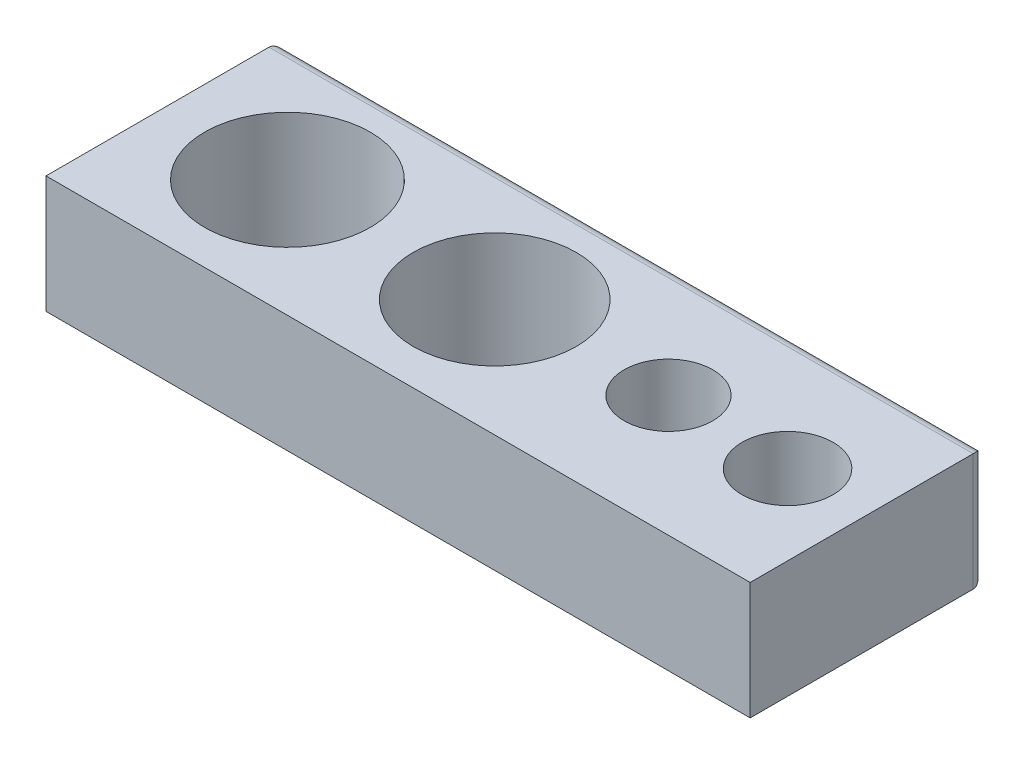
ISO-10303-21;
HEADER;
FILE_DESCRIPTION(('STEP AP214'),'2;1');
FILE_NAME('part.step','',(''),(''),'','','');
FILE_SCHEMA(('AUTOMOTIVE_DESIGN { 1 0 10303 214 1 1 1 1 }'));
ENDSEC;
DATA;
#1=APPLICATION_CONTEXT('core data for automotive mechanical design processes');
#2=APPLICATION_PROTOCOL_DEFINITION('international standard','automotive_design',2000,#1);
#3=PRODUCT_CONTEXT('',#1,'mechanical');
#4=PRODUCT('Part','Part','',(#3));
#5=PRODUCT_RELATED_PRODUCT_CATEGORY('part','',(#4));
#6=PRODUCT_DEFINITION_FORMATION('','',#4);
#7=PRODUCT_DEFINITION_CONTEXT('part definition',#1,'design');
#8=PRODUCT_DEFINITION('design','',#6,#7);
#9=PRODUCT_DEFINITION_SHAPE('','',#8);
#10=(LENGTH_UNIT() NAMED_UNIT(*) SI_UNIT(.MILLI.,.METRE.));
#11=(NAMED_UNIT(*) PLANE_ANGLE_UNIT() SI_UNIT($,.RADIAN.));
#12=(NAMED_UNIT(*) SI_UNIT($,.STERADIAN.) SOLID_ANGLE_UNIT());
#13=UNCERTAINTY_MEASURE_WITH_UNIT(LENGTH_MEASURE(1.E-05),#10,'distance_accuracy_value','');
#14=(GEOMETRIC_REPRESENTATION_CONTEXT(3) GLOBAL_UNCERTAINTY_ASSIGNED_CONTEXT((#13)) GLOBAL_UNIT_ASSIGNED_CONTEXT((#10,
#11,#12)) REPRESENTATION_CONTEXT('',''));
#15=CARTESIAN_POINT('',(0.,0.,0.));
#16=DIRECTION('',(0.,0.,1.));
#17=DIRECTION('',(1.,0.,0.));
#18=AXIS2_PLACEMENT_3D('',#15,#16,#17);
#19=CARTESIAN_POINT('',(15.,5.,-5.));
#20=DIRECTION('',(-1.,0.,0.));
#21=DIRECTION('',(0.,0.,1.));
#22=AXIS2_PLACEMENT_3D('',#19,#20,#21);
#23=PLANE('',#22);
#24=DIRECTION('',(0.,0.,-1.));
#25=VECTOR('',#24,1.);
#26=CARTESIAN_POINT('',(15.,0.,-5.));
#27=LINE('',#26,#25);
#28=CARTESIAN_POINT('',(15.,0.,5.));
#29=VERTEX_POINT('',#28);
#30=CARTESIAN_POINT('',(15.,0.,-4.5));
#31=VERTEX_POINT('',#30);
#32=EDGE_CURVE('E110',#29,#31,#27,.T.);
#33=ORIENTED_EDGE('',*,*,#32,.T.);
#34=DIRECTION('',(0.,-1.,0.));
#35=VECTOR('',#34,1.);
#36=CARTESIAN_POINT('',(15.,5.,-4.5));
#37=LINE('',#36,#35);
#38=CARTESIAN_POINT('',(15.,5.,-4.5));
#39=VERTEX_POINT('',#38);
#40=EDGE_CURVE('E124',#31,#39,#37,.F.);
#41=ORIENTED_EDGE('',*,*,#40,.T.);
#42=DIRECTION('',(0.,0.,-1.));
#43=VECTOR('',#42,1.);
#44=CARTESIAN_POINT('',(15.,5.,-5.));
#45=LINE('',#44,#43);
#46=CARTESIAN_POINT('',(15.,5.,5.));
#47=VERTEX_POINT('',#46);
#48=EDGE_CURVE('E92',#47,#39,#45,.T.);
#49=ORIENTED_EDGE('',*,*,#48,.F.);
#50=DIRECTION('',(0.,-1.,0.));
#51=VECTOR('',#50,1.);
#52=CARTESIAN_POINT('',(15.,5.,5.));
#53=LINE('',#52,#51);
#54=EDGE_CURVE('E101',#47,#29,#53,.T.);
#55=ORIENTED_EDGE('',*,*,#54,.T.);
#56=EDGE_LOOP('',(#33,#41,#49,#55));
#57=FACE_BOUND('',#56,.T.);
#58=ADVANCED_FACE('F35',(#57),#23,.F.);
#59=CARTESIAN_POINT('',(-15.,5.,-5.));
#60=DIRECTION('',(0.,0.,1.));
#61=DIRECTION('',(1.,0.,0.));
#62=AXIS2_PLACEMENT_3D('',#59,#60,#61);
#63=PLANE('',#62);
#64=DIRECTION('',(-1.,0.,0.));
#65=VECTOR('',#64,1.);
#66=CARTESIAN_POINT('',(15.,4.5,-5.));
#67=LINE('',#66,#65);
#68=CARTESIAN_POINT('',(-14.5,4.5,-5.));
#69=VERTEX_POINT('',#68);
#70=CARTESIAN_POINT('',(14.5,4.5,-5.));
#71=VERTEX_POINT('',#70);
#72=EDGE_CURVE('E119',#69,#71,#67,.F.);
#73=ORIENTED_EDGE('',*,*,#72,.T.);
#74=DIRECTION('',(0.,-1.,0.));
#75=VECTOR('',#74,1.);
#76=CARTESIAN_POINT('',(14.5,5.,-5.));
#77=LINE('',#76,#75);
#78=CARTESIAN_POINT('',(14.5,0.5,-5.));
#79=VERTEX_POINT('',#78);
#80=EDGE_CURVE('E121',#71,#79,#77,.T.);
#81=ORIENTED_EDGE('',*,*,#80,.T.);
#82=DIRECTION('',(-1.,0.,0.));
#83=VECTOR('',#82,1.);
#84=CARTESIAN_POINT('',(-15.,0.5,-5.));
#85=LINE('',#84,#83);
#86=CARTESIAN_POINT('',(-14.5,0.5,-5.));
#87=VERTEX_POINT('',#86);
#88=EDGE_CURVE('E100',#79,#87,#85,.T.);
#89=ORIENTED_EDGE('',*,*,#88,.T.);
#90=DIRECTION('',(0.,-1.,0.));
#91=VECTOR('',#90,1.);
#92=CARTESIAN_POINT('',(-14.5,5.,-5.));
#93=LINE('',#92,#91);
#94=EDGE_CURVE('E117',#87,#69,#93,.F.);
#95=ORIENTED_EDGE('',*,*,#94,.T.);
#96=EDGE_LOOP('',(#73,#81,#89,#95));
#97=FACE_BOUND('',#96,.T.);
#98=ADVANCED_FACE('F158',(#97),#63,.F.);
#99=CARTESIAN_POINT('',(-15.,5.,-5.));
#100=DIRECTION('',(1.,0.,0.));
#101=DIRECTION('',(0.,0.,-1.));
#102=AXIS2_PLACEMENT_3D('',#99,#100,#101);
#103=PLANE('',#102);
#104=DIRECTION('',(0.,0.,1.));
#105=VECTOR('',#104,1.);
#106=CARTESIAN_POINT('',(-15.,5.,-5.));
#107=LINE('',#106,#105);
#108=CARTESIAN_POINT('',(-15.,5.,-4.5));
#109=VERTEX_POINT('',#108);
#110=CARTESIAN_POINT('',(-15.,5.,5.));
#111=VERTEX_POINT('',#110);
#112=EDGE_CURVE('E86',#109,#111,#107,.T.);
#113=ORIENTED_EDGE('',*,*,#112,.F.);
#114=DIRECTION('',(0.,-1.,0.));
#115=VECTOR('',#114,1.);
#116=CARTESIAN_POINT('',(-15.,5.,-4.5));
#117=LINE('',#116,#115);
#118=CARTESIAN_POINT('',(-15.,0.,-4.5));
#119=VERTEX_POINT('',#118);
#120=EDGE_CURVE('E44',#109,#119,#117,.T.);
#121=ORIENTED_EDGE('',*,*,#120,.T.);
#122=DIRECTION('',(0.,0.,1.));
#123=VECTOR('',#122,1.);
#124=CARTESIAN_POINT('',(-15.,0.,-5.));
#125=LINE('',#124,#123);
#126=CARTESIAN_POINT('',(-15.,0.,5.));
#127=VERTEX_POINT('',#126);
#128=EDGE_CURVE('E97',#119,#127,#125,.T.);
#129=ORIENTED_EDGE('',*,*,#128,.T.);
#130=DIRECTION('',(0.,-1.,0.));
#131=VECTOR('',#130,1.);
#132=CARTESIAN_POINT('',(-15.,5.,5.));
#133=LINE('',#132,#131);
#134=EDGE_CURVE('E95',#111,#127,#133,.T.);
#135=ORIENTED_EDGE('',*,*,#134,.F.);
#136=EDGE_LOOP('',(#113,#121,#129,#135));
#137=FACE_BOUND('',#136,.T.);
#138=ADVANCED_FACE('F96',(#137),#103,.F.);
#139=CARTESIAN_POINT('',(-15.,5.,5.));
#140=DIRECTION('',(0.,0.,-1.));
#141=DIRECTION('',(-1.,0.,0.));
#142=AXIS2_PLACEMENT_3D('',#139,#140,#141);
#143=PLANE('',#142);
#144=DIRECTION('',(1.,0.,0.));
#145=VECTOR('',#144,1.);
#146=CARTESIAN_POINT('',(-15.,0.,5.));
#147=LINE('',#146,#145);
#148=EDGE_CURVE('E114',#127,#29,#147,.T.);
#149=ORIENTED_EDGE('',*,*,#148,.T.);
#150=ORIENTED_EDGE('',*,*,#54,.F.);
#151=DIRECTION('',(1.,0.,0.));
#152=VECTOR('',#151,1.);
#153=CARTESIAN_POINT('',(-15.,5.,5.));
#154=LINE('',#153,#152);
#155=EDGE_CURVE('E90',#111,#47,#154,.T.);
#156=ORIENTED_EDGE('',*,*,#155,.F.);
#157=ORIENTED_EDGE('',*,*,#134,.T.);
#158=EDGE_LOOP('',(#149,#150,#156,#157));
#159=FACE_BOUND('',#158,.T.);
#160=ADVANCED_FACE('F103',(#159),#143,.F.);
#161=CARTESIAN_POINT('',(0.,5.,0.));
#162=DIRECTION('',(0.,1.,0.));
#163=DIRECTION('',(0.,0.,1.));
#164=AXIS2_PLACEMENT_3D('',#161,#162,#163);
#165=PLANE('',#164);
#166=CARTESIAN_POINT('',(11.5935796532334,5.,0.));
#167=DIRECTION('',(0.,-1.,0.));
#168=DIRECTION('',(0.,0.,-1.));
#169=AXIS2_PLACEMENT_3D('',#166,#167,#168);
#170=CIRCLE('',#169,1.9375);
#171=CARTESIAN_POINT('',(11.5935796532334,5.,-1.9375));
#172=VERTEX_POINT('',#171);
#173=EDGE_CURVE('E254',#172,#172,#170,.T.);
#174=ORIENTED_EDGE('',*,*,#173,.T.);
#175=EDGE_LOOP('',(#174));
#176=FACE_BOUND('',#175,.T.);
#177=CARTESIAN_POINT('',(-9.71304577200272,5.,0.));
#178=DIRECTION('',(0.,-1.,0.));
#179=DIRECTION('',(0.,0.,-1.));
#180=AXIS2_PLACEMENT_3D('',#177,#178,#179);
#181=CIRCLE('',#180,3.525);
#182=CARTESIAN_POINT('',(-9.71304577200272,5.,-3.525));
#183=VERTEX_POINT('',#182);
#184=EDGE_CURVE('E261',#183,#183,#181,.T.);
#185=ORIENTED_EDGE('',*,*,#184,.T.);
#186=EDGE_LOOP('',(#185));
#187=FACE_BOUND('',#186,.T.);
#188=CARTESIAN_POINT('',(6.35406842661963,5.,-0.165046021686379));
#189=DIRECTION('',(0.,-1.,0.));
#190=DIRECTION('',(0.,0.,-1.));
#191=AXIS2_PLACEMENT_3D('',#188,#189,#190);
#192=CIRCLE('',#191,1.8875);
#193=CARTESIAN_POINT('',(6.35406842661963,5.,-2.05254602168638));
#194=VERTEX_POINT('',#193);
#195=EDGE_CURVE('E267',#194,#194,#192,.T.);
#196=ORIENTED_EDGE('',*,*,#195,.T.);
#197=EDGE_LOOP('',(#196));
#198=FACE_BOUND('',#197,.T.);
#199=CARTESIAN_POINT('',(-0.882694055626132,5.,0.));
#200=DIRECTION('',(0.,-1.,0.));
#201=DIRECTION('',(0.,0.,-1.));
#202=AXIS2_PLACEMENT_3D('',#199,#200,#201);
#203=CIRCLE('',#202,3.475);
#204=CARTESIAN_POINT('',(-0.882694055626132,5.,-3.475));
#205=VERTEX_POINT('',#204);
#206=EDGE_CURVE('E132',#205,#205,#203,.T.);
#207=ORIENTED_EDGE('',*,*,#206,.T.);
#208=EDGE_LOOP('',(#207));
#209=FACE_BOUND('',#208,.T.);
#210=ORIENTED_EDGE('',*,*,#48,.T.);
#211=DIRECTION('',(-1.,0.,0.));
#212=VECTOR('',#211,1.);
#213=CARTESIAN_POINT('',(-15.,5.,-4.5));
#214=LINE('',#213,#212);
#215=EDGE_CURVE('E59',#39,#109,#214,.T.);
#216=ORIENTED_EDGE('',*,*,#215,.T.);
#217=ORIENTED_EDGE('',*,*,#112,.T.);
#218=ORIENTED_EDGE('',*,*,#155,.T.);
#219=EDGE_LOOP('',(#210,#216,#217,#218));
#220=FACE_BOUND('',#219,.T.);
#221=ADVANCED_FACE('F88',(#176,#187,#198,#209,#220),#165,.T.);
#222=CARTESIAN_POINT('',(0.,0.,0.));
#223=DIRECTION('',(0.,1.,0.));
#224=DIRECTION('',(0.,0.,1.));
#225=AXIS2_PLACEMENT_3D('',#222,#223,#224);
#226=PLANE('',#225);
#227=CARTESIAN_POINT('',(11.5935796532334,0.,0.));
#228=DIRECTION('',(0.,-1.,0.));
#229=DIRECTION('',(0.,0.,-1.));
#230=AXIS2_PLACEMENT_3D('',#227,#228,#229);
#231=CIRCLE('',#230,1.9375);
#232=CARTESIAN_POINT('',(11.5935796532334,0.,-1.9375));
#233=VERTEX_POINT('',#232);
#234=EDGE_CURVE('E256',#233,#233,#231,.T.);
#235=ORIENTED_EDGE('',*,*,#234,.F.);
#236=EDGE_LOOP('',(#235));
#237=FACE_BOUND('',#236,.T.);
#238=CARTESIAN_POINT('',(-9.71304577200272,0.,0.));
#239=DIRECTION('',(0.,-1.,0.));
#240=DIRECTION('',(0.,0.,-1.));
#241=AXIS2_PLACEMENT_3D('',#238,#239,#240);
#242=CIRCLE('',#241,3.525);
#243=CARTESIAN_POINT('',(-9.71304577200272,0.,-3.525));
#244=VERTEX_POINT('',#243);
#245=EDGE_CURVE('E258',#244,#244,#242,.T.);
#246=ORIENTED_EDGE('',*,*,#245,.F.);
#247=EDGE_LOOP('',(#246));
#248=FACE_BOUND('',#247,.T.);
#249=CARTESIAN_POINT('',(6.35406842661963,0.,-0.165046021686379));
#250=DIRECTION('',(0.,-1.,0.));
#251=DIRECTION('',(0.,0.,-1.));
#252=AXIS2_PLACEMENT_3D('',#249,#250,#251);
#253=CIRCLE('',#252,1.8875);
#254=CARTESIAN_POINT('',(6.35406842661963,0.,-2.05254602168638));
#255=VERTEX_POINT('',#254);
#256=EDGE_CURVE('E264',#255,#255,#253,.T.);
#257=ORIENTED_EDGE('',*,*,#256,.F.);
#258=EDGE_LOOP('',(#257));
#259=FACE_BOUND('',#258,.T.);
#260=CARTESIAN_POINT('',(-0.882694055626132,0.,0.));
#261=DIRECTION('',(0.,-1.,0.));
#262=DIRECTION('',(0.,0.,-1.));
#263=AXIS2_PLACEMENT_3D('',#260,#261,#262);
#264=CIRCLE('',#263,3.475);
#265=CARTESIAN_POINT('',(-0.882694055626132,0.,-3.475));
#266=VERTEX_POINT('',#265);
#267=EDGE_CURVE('E270',#266,#266,#264,.T.);
#268=ORIENTED_EDGE('',*,*,#267,.F.);
#269=EDGE_LOOP('',(#268));
#270=FACE_BOUND('',#269,.T.);
#271=ORIENTED_EDGE('',*,*,#128,.F.);
#272=DIRECTION('',(-1.,0.,0.));
#273=VECTOR('',#272,1.);
#274=CARTESIAN_POINT('',(0.,0.,-4.5));
#275=LINE('',#274,#273);
#276=EDGE_CURVE('E11',#119,#31,#275,.F.);
#277=ORIENTED_EDGE('',*,*,#276,.T.);
#278=ORIENTED_EDGE('',*,*,#32,.F.);
#279=ORIENTED_EDGE('',*,*,#148,.F.);
#280=EDGE_LOOP('',(#271,#277,#278,#279));
#281=FACE_BOUND('',#280,.T.);
#282=ADVANCED_FACE('F151',(#237,#248,#259,#270,#281),#226,.F.);
#283=CARTESIAN_POINT('',(-14.5,5.,-4.5));
#284=DIRECTION('',(0.,-1.,0.));
#285=DIRECTION('',(0.,0.,-1.));
#286=AXIS2_PLACEMENT_3D('',#283,#284,#285);
#287=CYLINDRICAL_SURFACE('',#286,0.5);
#288=CARTESIAN_POINT('',(-14.5,0.5,-4.5));
#289=DIRECTION('',(-0.707106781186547,0.707106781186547,0.));
#290=DIRECTION('',(-0.707106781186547,-0.707106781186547,0.));
#291=AXIS2_PLACEMENT_3D('',#288,#289,#290);
#292=ELLIPSE('',#291,0.707106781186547,0.5);
#293=EDGE_CURVE('E133',#119,#87,#292,.F.);
#294=ORIENTED_EDGE('',*,*,#293,.F.);
#295=ORIENTED_EDGE('',*,*,#120,.F.);
#296=CARTESIAN_POINT('',(-14.5,4.5,-4.5));
#297=DIRECTION('',(-0.707106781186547,-0.707106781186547,0.));
#298=DIRECTION('',(0.707106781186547,-0.707106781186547,0.));
#299=AXIS2_PLACEMENT_3D('',#296,#297,#298);
#300=ELLIPSE('',#299,0.707106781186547,0.5);
#301=EDGE_CURVE('E39',#69,#109,#300,.F.);
#302=ORIENTED_EDGE('',*,*,#301,.F.);
#303=ORIENTED_EDGE('',*,*,#94,.F.);
#304=EDGE_LOOP('',(#294,#295,#302,#303));
#305=FACE_BOUND('',#304,.T.);
#306=ADVANCED_FACE('F37',(#305),#287,.T.);
#307=CARTESIAN_POINT('',(0.,4.5,-4.5));
#308=DIRECTION('',(1.,0.,0.));
#309=DIRECTION('',(0.,0.,-1.));
#310=AXIS2_PLACEMENT_3D('',#307,#308,#309);
#311=CYLINDRICAL_SURFACE('',#310,0.5);
#312=ORIENTED_EDGE('',*,*,#301,.T.);
#313=ORIENTED_EDGE('',*,*,#215,.F.);
#314=CARTESIAN_POINT('',(14.5,4.5,-4.5));
#315=DIRECTION('',(0.707106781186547,-0.707106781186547,0.));
#316=DIRECTION('',(0.707106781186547,0.707106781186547,0.));
#317=AXIS2_PLACEMENT_3D('',#314,#315,#316);
#318=ELLIPSE('',#317,0.707106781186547,0.5);
#319=EDGE_CURVE('E131',#71,#39,#318,.T.);
#320=ORIENTED_EDGE('',*,*,#319,.F.);
#321=ORIENTED_EDGE('',*,*,#72,.F.);
#322=EDGE_LOOP('',(#312,#313,#320,#321));
#323=FACE_BOUND('',#322,.T.);
#324=ADVANCED_FACE('F143',(#323),#311,.T.);
#325=CARTESIAN_POINT('',(-15.,0.5,-4.5));
#326=DIRECTION('',(-1.,0.,0.));
#327=DIRECTION('',(0.,0.,1.));
#328=AXIS2_PLACEMENT_3D('',#325,#326,#327);
#329=CYLINDRICAL_SURFACE('',#328,0.5);
#330=ORIENTED_EDGE('',*,*,#293,.T.);
#331=ORIENTED_EDGE('',*,*,#88,.F.);
#332=CARTESIAN_POINT('',(14.5,0.5,-4.5));
#333=DIRECTION('',(-0.707106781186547,-0.707106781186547,0.));
#334=DIRECTION('',(-0.707106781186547,0.707106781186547,0.));
#335=AXIS2_PLACEMENT_3D('',#332,#333,#334);
#336=ELLIPSE('',#335,0.707106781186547,0.5);
#337=EDGE_CURVE('E129',#31,#79,#336,.F.);
#338=ORIENTED_EDGE('',*,*,#337,.F.);
#339=ORIENTED_EDGE('',*,*,#276,.F.);
#340=EDGE_LOOP('',(#330,#331,#338,#339));
#341=FACE_BOUND('',#340,.T.);
#342=ADVANCED_FACE('F148',(#341),#329,.T.);
#343=CARTESIAN_POINT('',(14.5,5.,-4.5));
#344=DIRECTION('',(0.,-1.,0.));
#345=DIRECTION('',(0.,0.,-1.));
#346=AXIS2_PLACEMENT_3D('',#343,#344,#345);
#347=CYLINDRICAL_SURFACE('',#346,0.5);
#348=ORIENTED_EDGE('',*,*,#319,.T.);
#349=ORIENTED_EDGE('',*,*,#40,.F.);
#350=ORIENTED_EDGE('',*,*,#337,.T.);
#351=ORIENTED_EDGE('',*,*,#80,.F.);
#352=EDGE_LOOP('',(#348,#349,#350,#351));
#353=FACE_BOUND('',#352,.T.);
#354=ADVANCED_FACE('F155',(#353),#347,.T.);
#355=CARTESIAN_POINT('',(-0.882694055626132,5.,0.));
#356=DIRECTION('',(0.,-1.,0.));
#357=DIRECTION('',(0.,0.,-1.));
#358=AXIS2_PLACEMENT_3D('',#355,#356,#357);
#359=CYLINDRICAL_SURFACE('',#358,3.475);
#360=ORIENTED_EDGE('',*,*,#206,.F.);
#361=EDGE_LOOP('',(#360));
#362=FACE_BOUND('',#361,.T.);
#363=ORIENTED_EDGE('',*,*,#267,.T.);
#364=EDGE_LOOP('',(#363));
#365=FACE_BOUND('',#364,.T.);
#366=ADVANCED_FACE('F171',(#362,#365),#359,.F.);
#367=CARTESIAN_POINT('',(6.35406842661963,5.,-0.165046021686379));
#368=DIRECTION('',(0.,-1.,0.));
#369=DIRECTION('',(0.,0.,-1.));
#370=AXIS2_PLACEMENT_3D('',#367,#368,#369);
#371=CYLINDRICAL_SURFACE('',#370,1.8875);
#372=ORIENTED_EDGE('',*,*,#195,.F.);
#373=EDGE_LOOP('',(#372));
#374=FACE_BOUND('',#373,.T.);
#375=ORIENTED_EDGE('',*,*,#256,.T.);
#376=EDGE_LOOP('',(#375));
#377=FACE_BOUND('',#376,.T.);
#378=ADVANCED_FACE('F218',(#374,#377),#371,.F.);
#379=CARTESIAN_POINT('',(-9.71304577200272,5.,0.));
#380=DIRECTION('',(0.,-1.,0.));
#381=DIRECTION('',(0.,0.,-1.));
#382=AXIS2_PLACEMENT_3D('',#379,#380,#381);
#383=CYLINDRICAL_SURFACE('',#382,3.525);
#384=ORIENTED_EDGE('',*,*,#184,.F.);
#385=EDGE_LOOP('',(#384));
#386=FACE_BOUND('',#385,.T.);
#387=ORIENTED_EDGE('',*,*,#245,.T.);
#388=EDGE_LOOP('',(#387));
#389=FACE_BOUND('',#388,.T.);
#390=ADVANCED_FACE('F227',(#386,#389),#383,.F.);
#391=CARTESIAN_POINT('',(11.5935796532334,5.,0.));
#392=DIRECTION('',(0.,-1.,0.));
#393=DIRECTION('',(0.,0.,-1.));
#394=AXIS2_PLACEMENT_3D('',#391,#392,#393);
#395=CYLINDRICAL_SURFACE('',#394,1.9375);
#396=ORIENTED_EDGE('',*,*,#173,.F.);
#397=EDGE_LOOP('',(#396));
#398=FACE_BOUND('',#397,.T.);
#399=ORIENTED_EDGE('',*,*,#234,.T.);
#400=EDGE_LOOP('',(#399));
#401=FACE_BOUND('',#400,.T.);
#402=ADVANCED_FACE('F237',(#398,#401),#395,.F.);
#403=CLOSED_SHELL('',(#58,#98,#138,#160,#221,#282,#306,#324,#342,#354,#366,#378,#390,#402));
#404=MANIFOLD_SOLID_BREP('B2',#403);
#405=ADVANCED_BREP_SHAPE_REPRESENTATION('',(#18,#404),#14);
#406=SHAPE_DEFINITION_REPRESENTATION(#9,#405);
ENDSEC;
END-ISO-10303-21;
